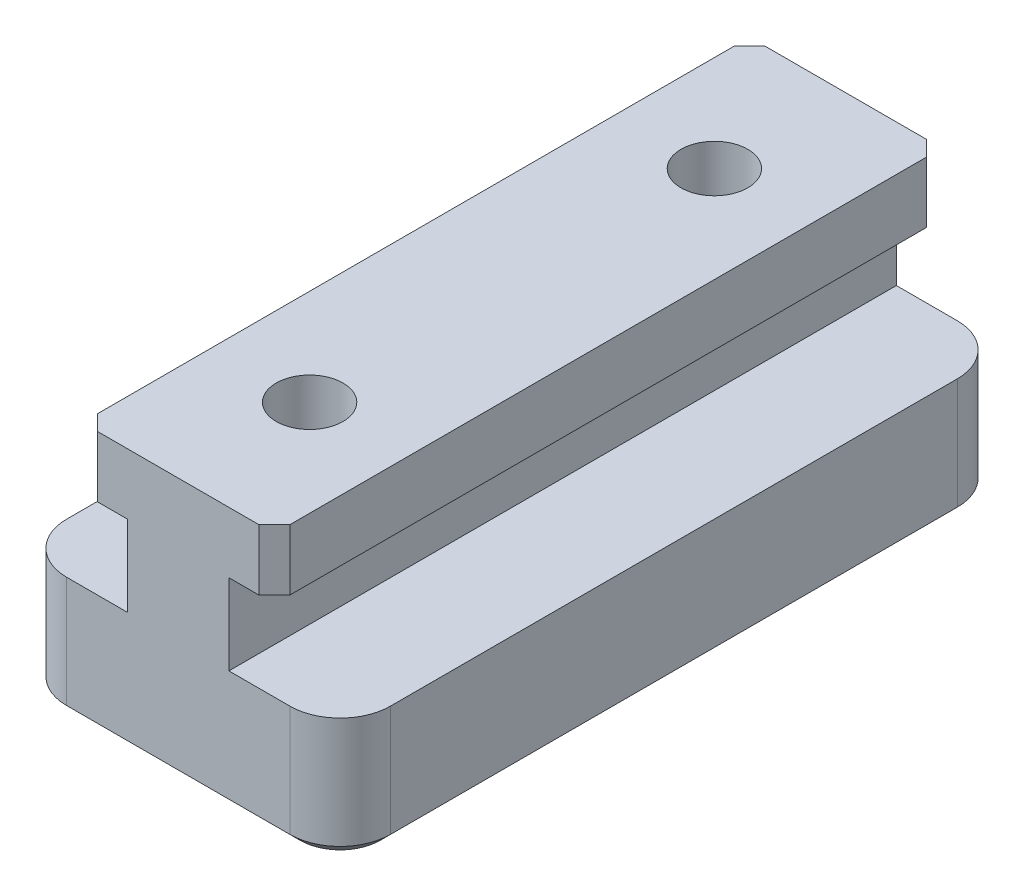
from build123d import *

# Parameters (mm, degrees)
BOSS_EXTRUDE1_DEPTH   = 16.49
FILLET1_R             = 2.4892
CHAMFER1_SIZE         = 0.508
CHAMFER3_SIZE         = 0.762
M4X0_7_TAPPED_HOLE1_D = 3.3


with BuildPart() as part:
    # Sketch1 → Boss-Extrude1 (new, symmetric)
    with BuildSketch(Plane.XY):
        Polygon((4.7498, 5.0038), (-4.7498, 5.0038), (-4.7498, 1.9916), (-2.5019, 1.9916), (-2.5019, -1.9962), (-8, -1.9962), (-8, -7.9962), (8, -7.9962), (8, -1.9962), (2.5019, -1.9962), (2.5019, 1.9916), (4.7498, 1.9916), align=None)
    extrude(amount=BOSS_EXTRUDE1_DEPTH, both=True)

    # Fillet1
    fillet1_edges = [part.edges().sort_by_distance(p)[0] for p in [
        (8, -4.9962, -16.49),
        (-8, -4.9962, -16.49),
        (-8, -4.9962, 16.49),
        (8, -4.9962, 16.49),
    ]]
    fillet(fillet1_edges, radius=FILLET1_R)

    # Chamfer1
    chamfer1_edges = [part.edges().sort_by_distance(p)[0] for p in [
        (0, -7.9962, 16.49),
        (0, -7.9962, -16.49),
        (8, -7.9962, 0),
        (-8, -7.9962, 0),
        (7.2709302, -7.9962, 15.7609302),
        (7.2709302, -7.9962, -15.7609302),
        (-7.2709302, -7.9962, -15.7609302),
        (-7.2709302, -7.9962, 15.7609302),
    ]]
    chamfer(chamfer1_edges, length=CHAMFER1_SIZE)

    # Chamfer3
    chamfer3_edges = [part.edges().sort_by_distance(p)[0] for p in [
        (4.7498, 3.4977, -16.49),
        (-4.7498, 3.4977, -16.49),
        (4.7498, 3.4977, 16.49),
        (-4.7498, 3.4977, 16.49),
    ]]
    chamfer(chamfer3_edges, length=CHAMFER3_SIZE)

    # M4x0.7 Tapped Hole1 (through all)
    with Locations(Plane(origin=(0, -7.9962, 0), x_dir=(-1, 0, 0), z_dir=(0, -1, 0))):
        with Locations((0, 10)):
            m4x0_7_tapped_hole1 = Hole(M4X0_7_TAPPED_HOLE1_D / 2)

    # Mirror1: M4x0.7 Tapped Hole1 across plane
    add(m4x0_7_tapped_hole1.mirror(Plane.XY), mode=Mode.SUBTRACT)


solid = part.part
